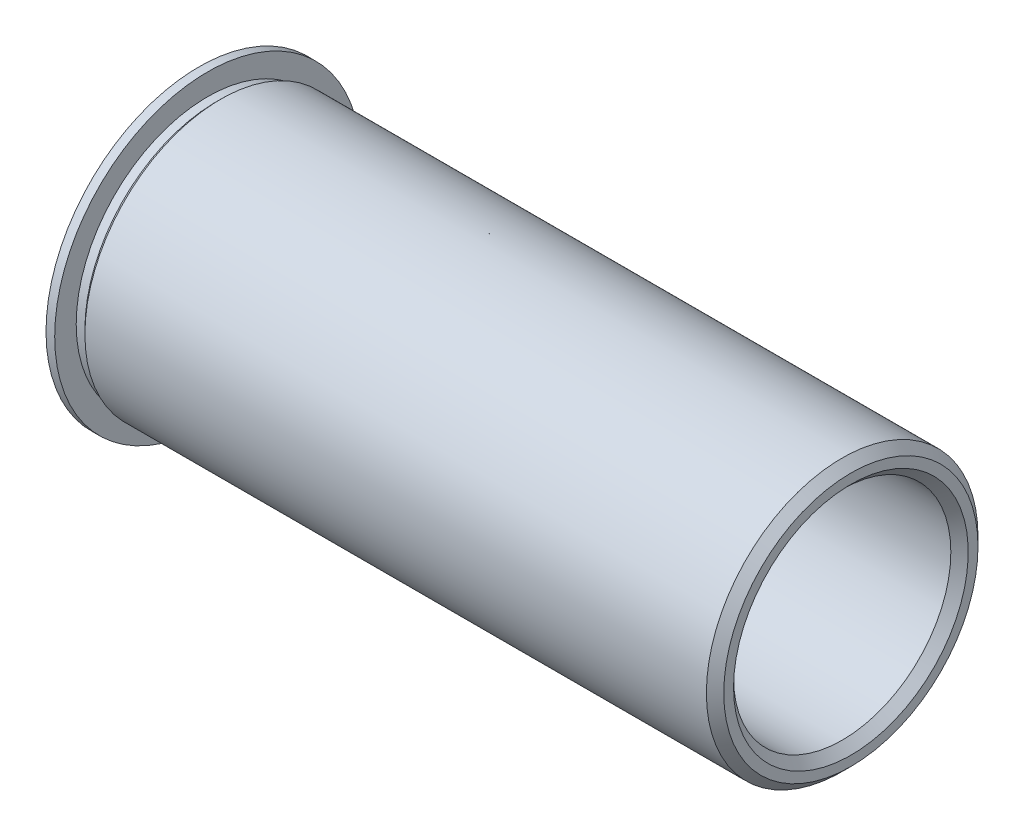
ISO-10303-21;
HEADER;
FILE_DESCRIPTION(('STEP AP214'),'2;1');
FILE_NAME('part.step','',(''),(''),'','','');
FILE_SCHEMA(('AUTOMOTIVE_DESIGN { 1 0 10303 214 1 1 1 1 }'));
ENDSEC;
DATA;
#1=APPLICATION_CONTEXT('core data for automotive mechanical design processes');
#2=APPLICATION_PROTOCOL_DEFINITION('international standard','automotive_design',2000,#1);
#3=PRODUCT_CONTEXT('',#1,'mechanical');
#4=PRODUCT('Part','Part','',(#3));
#5=PRODUCT_RELATED_PRODUCT_CATEGORY('part','',(#4));
#6=PRODUCT_DEFINITION_FORMATION('','',#4);
#7=PRODUCT_DEFINITION_CONTEXT('part definition',#1,'design');
#8=PRODUCT_DEFINITION('design','',#6,#7);
#9=PRODUCT_DEFINITION_SHAPE('','',#8);
#10=(LENGTH_UNIT() NAMED_UNIT(*) SI_UNIT(.MILLI.,.METRE.));
#11=(NAMED_UNIT(*) PLANE_ANGLE_UNIT() SI_UNIT($,.RADIAN.));
#12=(NAMED_UNIT(*) SI_UNIT($,.STERADIAN.) SOLID_ANGLE_UNIT());
#13=UNCERTAINTY_MEASURE_WITH_UNIT(LENGTH_MEASURE(1.E-05),#10,'distance_accuracy_value','');
#14=(GEOMETRIC_REPRESENTATION_CONTEXT(3) GLOBAL_UNCERTAINTY_ASSIGNED_CONTEXT((#13)) GLOBAL_UNIT_ASSIGNED_CONTEXT((#10,
#11,#12)) REPRESENTATION_CONTEXT('',''));
#15=CARTESIAN_POINT('',(0.,0.,0.));
#16=DIRECTION('',(0.,0.,1.));
#17=DIRECTION('',(1.,0.,0.));
#18=AXIS2_PLACEMENT_3D('',#15,#16,#17);
#19=CARTESIAN_POINT('',(-45.0910828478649,94.6526873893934,0.));
#20=DIRECTION('',(-1.,0.,0.));
#21=DIRECTION('',(0.,0.,1.));
#22=AXIS2_PLACEMENT_3D('',#19,#20,#21);
#23=PLANE('',#22);
#24=CARTESIAN_POINT('',(-45.0910828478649,94.6526873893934,0.));
#25=DIRECTION('',(-1.,0.,0.));
#26=DIRECTION('',(0.,0.,1.));
#27=AXIS2_PLACEMENT_3D('',#24,#25,#26);
#28=CIRCLE('',#27,3.42899999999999);
#29=CARTESIAN_POINT('',(-45.0910828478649,94.6526873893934,3.42899999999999));
#30=VERTEX_POINT('',#29);
#31=EDGE_CURVE('E10',#30,#30,#28,.T.);
#32=ORIENTED_EDGE('',*,*,#31,.T.);
#33=EDGE_LOOP('',(#32));
#34=FACE_BOUND('',#33,.T.);
#35=CARTESIAN_POINT('',(-45.0910828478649,94.6526873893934,0.));
#36=DIRECTION('',(-1.,0.,0.));
#37=DIRECTION('',(0.,0.,1.));
#38=AXIS2_PLACEMENT_3D('',#35,#36,#37);
#39=CIRCLE('',#38,3.71475);
#40=CARTESIAN_POINT('',(-45.0910828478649,94.6526873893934,3.71475));
#41=VERTEX_POINT('',#40);
#42=EDGE_CURVE('E53',#41,#41,#39,.T.);
#43=ORIENTED_EDGE('',*,*,#42,.F.);
#44=EDGE_LOOP('',(#43));
#45=FACE_BOUND('',#44,.T.);
#46=ADVANCED_FACE('F33',(#34,#45),#23,.F.);
#47=CARTESIAN_POINT('',(-45.0910828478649,94.6526873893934,0.));
#48=DIRECTION('',(-1.,0.,0.));
#49=DIRECTION('',(0.,0.,1.));
#50=AXIS2_PLACEMENT_3D('',#47,#48,#49);
#51=CONICAL_SURFACE('',#50,3.71475,0.785398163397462);
#52=CARTESIAN_POINT('',(-45.3450828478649,94.6526873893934,0.));
#53=DIRECTION('',(-1.,0.,0.));
#54=DIRECTION('',(0.,0.,1.));
#55=AXIS2_PLACEMENT_3D('',#52,#53,#54);
#56=CIRCLE('',#55,3.96875000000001);
#57=CARTESIAN_POINT('',(-45.3450828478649,94.6526873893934,3.96875000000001));
#58=VERTEX_POINT('',#57);
#59=EDGE_CURVE('E56',#58,#58,#56,.T.);
#60=ORIENTED_EDGE('',*,*,#59,.F.);
#61=EDGE_LOOP('',(#60));
#62=FACE_BOUND('',#61,.T.);
#63=ORIENTED_EDGE('',*,*,#42,.T.);
#64=EDGE_LOOP('',(#63));
#65=FACE_BOUND('',#64,.T.);
#66=ADVANCED_FACE('F104',(#62,#65),#51,.T.);
#67=CARTESIAN_POINT('',(-64.141082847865,94.6526873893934,0.));
#68=DIRECTION('',(-1.,0.,0.));
#69=DIRECTION('',(0.,0.,1.));
#70=AXIS2_PLACEMENT_3D('',#67,#68,#69);
#71=CYLINDRICAL_SURFACE('',#70,3.96875000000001);
#72=CARTESIAN_POINT('',(-63.5060828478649,94.6526873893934,0.));
#73=DIRECTION('',(-1.,0.,0.));
#74=DIRECTION('',(0.,0.,1.));
#75=AXIS2_PLACEMENT_3D('',#72,#73,#74);
#76=CIRCLE('',#75,3.96875000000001);
#77=CARTESIAN_POINT('',(-63.5060828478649,94.6526873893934,3.96875000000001));
#78=VERTEX_POINT('',#77);
#79=EDGE_CURVE('E59',#78,#78,#76,.T.);
#80=ORIENTED_EDGE('',*,*,#79,.F.);
#81=EDGE_LOOP('',(#80));
#82=FACE_BOUND('',#81,.T.);
#83=ORIENTED_EDGE('',*,*,#59,.T.);
#84=EDGE_LOOP('',(#83));
#85=FACE_BOUND('',#84,.T.);
#86=ADVANCED_FACE('F98',(#82,#85),#71,.T.);
#87=CARTESIAN_POINT('',(-63.5060828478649,94.6526873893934,0.));
#88=DIRECTION('',(1.,0.,0.));
#89=DIRECTION('',(0.,0.,-1.));
#90=AXIS2_PLACEMENT_3D('',#87,#88,#89);
#91=CONICAL_SURFACE('',#90,3.96875000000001,0.785398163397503);
#92=CARTESIAN_POINT('',(-63.6330828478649,94.6526873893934,0.));
#93=DIRECTION('',(-1.,0.,0.));
#94=DIRECTION('',(0.,0.,1.));
#95=AXIS2_PLACEMENT_3D('',#92,#93,#94);
#96=CIRCLE('',#95,3.84175);
#97=CARTESIAN_POINT('',(-63.6330828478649,94.6526873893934,3.84175));
#98=VERTEX_POINT('',#97);
#99=EDGE_CURVE('E62',#98,#98,#96,.T.);
#100=ORIENTED_EDGE('',*,*,#99,.F.);
#101=EDGE_LOOP('',(#100));
#102=FACE_BOUND('',#101,.T.);
#103=ORIENTED_EDGE('',*,*,#79,.T.);
#104=EDGE_LOOP('',(#103));
#105=FACE_BOUND('',#104,.T.);
#106=ADVANCED_FACE('F92',(#102,#105),#91,.T.);
#107=CARTESIAN_POINT('',(-64.141082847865,94.6526873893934,0.));
#108=DIRECTION('',(-1.,0.,0.));
#109=DIRECTION('',(0.,0.,1.));
#110=AXIS2_PLACEMENT_3D('',#107,#108,#109);
#111=CYLINDRICAL_SURFACE('',#110,3.84175);
#112=CARTESIAN_POINT('',(-63.8870828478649,94.6526873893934,0.));
#113=DIRECTION('',(-1.,0.,0.));
#114=DIRECTION('',(0.,0.,1.));
#115=AXIS2_PLACEMENT_3D('',#112,#113,#114);
#116=CIRCLE('',#115,3.84175);
#117=CARTESIAN_POINT('',(-63.8870828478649,94.6526873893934,3.84175));
#118=VERTEX_POINT('',#117);
#119=EDGE_CURVE('E65',#118,#118,#116,.T.);
#120=ORIENTED_EDGE('',*,*,#119,.F.);
#121=EDGE_LOOP('',(#120));
#122=FACE_BOUND('',#121,.T.);
#123=ORIENTED_EDGE('',*,*,#99,.T.);
#124=EDGE_LOOP('',(#123));
#125=FACE_BOUND('',#124,.T.);
#126=ADVANCED_FACE('F86',(#122,#125),#111,.T.);
#127=CARTESIAN_POINT('',(-63.8870828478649,98.4944373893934,0.));
#128=DIRECTION('',(-1.,0.,0.));
#129=DIRECTION('',(0.,0.,1.));
#130=AXIS2_PLACEMENT_3D('',#127,#128,#129);
#131=PLANE('',#130);
#132=CARTESIAN_POINT('',(-63.8870828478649,94.6526873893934,0.));
#133=DIRECTION('',(-1.,0.,0.));
#134=DIRECTION('',(0.,0.,1.));
#135=AXIS2_PLACEMENT_3D('',#132,#133,#134);
#136=CIRCLE('',#135,4.47040000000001);
#137=CARTESIAN_POINT('',(-63.8870828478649,94.6526873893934,4.47040000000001));
#138=VERTEX_POINT('',#137);
#139=EDGE_CURVE('E68',#138,#138,#136,.T.);
#140=ORIENTED_EDGE('',*,*,#139,.F.);
#141=EDGE_LOOP('',(#140));
#142=FACE_BOUND('',#141,.T.);
#143=ORIENTED_EDGE('',*,*,#119,.T.);
#144=EDGE_LOOP('',(#143));
#145=FACE_BOUND('',#144,.T.);
#146=ADVANCED_FACE('F80',(#142,#145),#131,.F.);
#147=CARTESIAN_POINT('',(-64.141082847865,94.6526873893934,0.));
#148=DIRECTION('',(-1.,0.,0.));
#149=DIRECTION('',(0.,0.,1.));
#150=AXIS2_PLACEMENT_3D('',#147,#148,#149);
#151=CYLINDRICAL_SURFACE('',#150,4.47040000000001);
#152=CARTESIAN_POINT('',(-64.141082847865,94.6526873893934,0.));
#153=DIRECTION('',(-1.,0.,0.));
#154=DIRECTION('',(0.,0.,1.));
#155=AXIS2_PLACEMENT_3D('',#152,#153,#154);
#156=CIRCLE('',#155,4.4704);
#157=CARTESIAN_POINT('',(-64.141082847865,94.6526873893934,4.4704));
#158=VERTEX_POINT('',#157);
#159=EDGE_CURVE('E71',#158,#158,#156,.T.);
#160=ORIENTED_EDGE('',*,*,#159,.F.);
#161=EDGE_LOOP('',(#160));
#162=FACE_BOUND('',#161,.T.);
#163=ORIENTED_EDGE('',*,*,#139,.T.);
#164=EDGE_LOOP('',(#163));
#165=FACE_BOUND('',#164,.T.);
#166=ADVANCED_FACE('F77',(#162,#165),#151,.T.);
#167=CARTESIAN_POINT('',(-64.141082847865,94.6526873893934,0.));
#168=DIRECTION('',(1.,0.,0.));
#169=DIRECTION('',(0.,0.,-1.));
#170=AXIS2_PLACEMENT_3D('',#167,#168,#169);
#171=PLANE('',#170);
#172=CARTESIAN_POINT('',(-64.141082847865,94.6526873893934,0.));
#173=DIRECTION('',(1.,0.,0.));
#174=DIRECTION('',(0.,0.,-1.));
#175=AXIS2_PLACEMENT_3D('',#172,#173,#174);
#176=CIRCLE('',#175,3.42900000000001);
#177=CARTESIAN_POINT('',(-64.141082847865,94.6526873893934,-3.42900000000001));
#178=VERTEX_POINT('',#177);
#179=EDGE_CURVE('E48',#178,#178,#176,.T.);
#180=ORIENTED_EDGE('',*,*,#179,.T.);
#181=EDGE_LOOP('',(#180));
#182=FACE_BOUND('',#181,.T.);
#183=ORIENTED_EDGE('',*,*,#159,.T.);
#184=EDGE_LOOP('',(#183));
#185=FACE_BOUND('',#184,.T.);
#186=ADVANCED_FACE('F75',(#182,#185),#171,.F.);
#187=CARTESIAN_POINT('',(-64.141082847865,94.6526873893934,0.));
#188=DIRECTION('',(1.,0.,0.));
#189=DIRECTION('',(0.,0.,-1.));
#190=AXIS2_PLACEMENT_3D('',#187,#188,#189);
#191=CYLINDRICAL_SURFACE('',#190,3.175);
#192=CARTESIAN_POINT('',(-45.3450828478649,94.6526873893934,0.));
#193=DIRECTION('',(-1.,0.,0.));
#194=DIRECTION('',(0.,0.,1.));
#195=AXIS2_PLACEMENT_3D('',#192,#193,#194);
#196=CIRCLE('',#195,3.175);
#197=CARTESIAN_POINT('',(-45.3450828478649,94.6526873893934,3.175));
#198=VERTEX_POINT('',#197);
#199=EDGE_CURVE('E40',#198,#198,#196,.F.);
#200=ORIENTED_EDGE('',*,*,#199,.T.);
#201=EDGE_LOOP('',(#200));
#202=FACE_BOUND('',#201,.T.);
#203=CARTESIAN_POINT('',(-63.8870828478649,94.6526873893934,0.));
#204=DIRECTION('',(1.,0.,0.));
#205=DIRECTION('',(0.,0.,-1.));
#206=AXIS2_PLACEMENT_3D('',#203,#204,#205);
#207=CIRCLE('',#206,3.175);
#208=CARTESIAN_POINT('',(-63.8870828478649,94.6526873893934,-3.175));
#209=VERTEX_POINT('',#208);
#210=EDGE_CURVE('E44',#209,#209,#207,.F.);
#211=ORIENTED_EDGE('',*,*,#210,.T.);
#212=EDGE_LOOP('',(#211));
#213=FACE_BOUND('',#212,.T.);
#214=ADVANCED_FACE('F119',(#202,#213),#191,.F.);
#215=CARTESIAN_POINT('',(-64.141082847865,94.6526873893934,0.));
#216=DIRECTION('',(-1.,0.,0.));
#217=DIRECTION('',(0.,0.,1.));
#218=AXIS2_PLACEMENT_3D('',#215,#216,#217);
#219=CONICAL_SURFACE('',#218,3.42900000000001,0.785398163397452);
#220=ORIENTED_EDGE('',*,*,#210,.F.);
#221=EDGE_LOOP('',(#220));
#222=FACE_BOUND('',#221,.T.);
#223=ORIENTED_EDGE('',*,*,#179,.F.);
#224=EDGE_LOOP('',(#223));
#225=FACE_BOUND('',#224,.T.);
#226=ADVANCED_FACE('F117',(#222,#225),#219,.F.);
#227=CARTESIAN_POINT('',(-45.3450828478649,94.6526873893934,0.));
#228=DIRECTION('',(1.,0.,0.));
#229=DIRECTION('',(0.,0.,-1.));
#230=AXIS2_PLACEMENT_3D('',#227,#228,#229);
#231=CONICAL_SURFACE('',#230,3.175,0.785398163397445);
#232=ORIENTED_EDGE('',*,*,#31,.F.);
#233=EDGE_LOOP('',(#232));
#234=FACE_BOUND('',#233,.T.);
#235=ORIENTED_EDGE('',*,*,#199,.F.);
#236=EDGE_LOOP('',(#235));
#237=FACE_BOUND('',#236,.T.);
#238=ADVANCED_FACE('F35',(#234,#237),#231,.F.);
#239=CLOSED_SHELL('',(#46,#66,#86,#106,#126,#146,#166,#186,#214,#226,#238));
#240=MANIFOLD_SOLID_BREP('B2',#239);
#241=ADVANCED_BREP_SHAPE_REPRESENTATION('',(#18,#240),#14);
#242=SHAPE_DEFINITION_REPRESENTATION(#9,#241);
ENDSEC;
END-ISO-10303-21;
